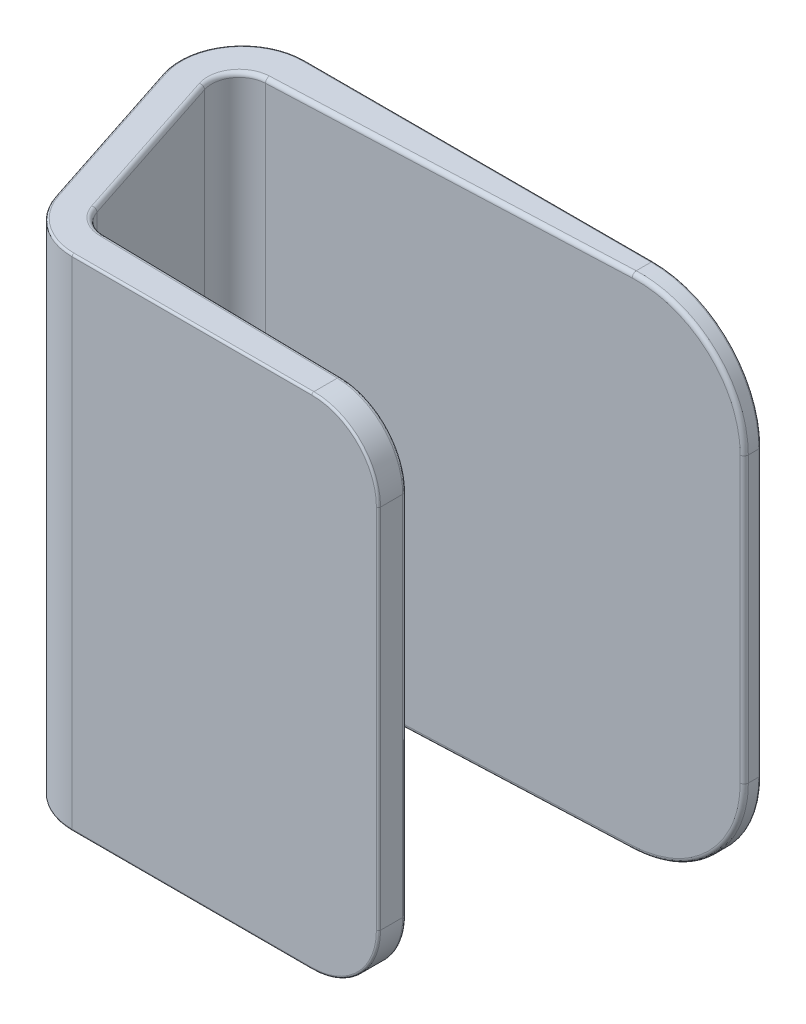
from build123d import *

# Parameters (mm, degrees)
BOSS_EXTRUDE1_DEPTH = 152.4
FILLET1_R           = 19.05
FILLET2_R           = 8.382
FILLET3_R           = 20.32
FILLET4_R           = 32.87776
FILLET5_R           = 0.635
FILLET6_R           = 1.27


with BuildPart() as part:
    # Sketch2 → Boss-Extrude1 (new body)
    with BuildSketch(Plane(origin=(0, 0, 0), x_dir=(1, 0, 0), z_dir=(0, 1, 0))):
        Polygon((165.424623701, 0), (0, 0), (28.419570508, -86.872569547), (135.656203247, -86.872569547), (135.656203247, -78.232006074), (35.451480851, -76.324704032), (14.209785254, -11.393368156), (165.424623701, -5.068012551), align=None)
    extrude(amount=BOSS_EXTRUDE1_DEPTH)

    # Fillet1
    fillet1_edges = [part.edges().sort_by_distance(p)[0] for p in [
        (28.419570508, 76.2, 86.872569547),
        (0, 76.2, 0),
    ]]
    fillet(fillet1_edges, radius=FILLET1_R)

    # Fillet2
    fillet2_edges = [part.edges().sort_by_distance(p)[0] for p in [
        (14.209785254, 76.2, 11.393368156),
        (35.451480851, 76.2, 76.324704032),
    ]]
    fillet(fillet2_edges, radius=FILLET2_R)

    # Fillet3
    fillet3_edges = [part.edges().sort_by_distance(p)[0] for p in [
        (135.656203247, 152.4, 82.552287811),
        (135.656203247, 0, 82.552287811),
    ]]
    fillet(fillet3_edges, radius=FILLET3_R)

    # Fillet4
    fillet4_edges = [part.edges().sort_by_distance(p)[0] for p in [
        (165.424623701, 0, 2.534006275),
        (165.424623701, 152.4, 2.534006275),
    ]]
    fillet(fillet4_edges, radius=FILLET4_R)

    # Fillet5
    fillet5_edges = [part.edges().sort_by_distance(p)[0] for p in [
        (78.783605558, 0, 86.872569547),
        (78.783605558, 152.4, 86.872569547),
        (16.147485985, 0, 49.359422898),
        (10.852498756, 0, 7.868168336),
        (31.049176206, 0, 83.245576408),
        (16.147485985, 152.4, 49.359422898),
        (10.852498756, 152.4, 7.868168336),
        (31.049176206, 152.4, 83.245576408),
        (135.656203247, 76.2, 86.872569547),
        (129.70461304, 146.448409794, 86.872569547),
        (129.70461304, 5.951590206, 86.872569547),
        (165.424623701, 76.2, 0),
        (79.411184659, 0, 0),
        (79.411184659, 152.4, 0),
        (155.794950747, 142.770327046, 0),
        (155.794950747, 9.629672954, 0),
    ]]
    fillet(fillet5_edges, radius=FILLET5_R)

    # Fillet6
    fillet6_edges = [part.edges().sort_by_distance(p)[0] for p in [
        (25.625156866, 0, 46.287726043),
        (25.625156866, 152.4, 46.287726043),
        (78.906924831, 0, 8.687070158),
        (78.906924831, 152.4, 8.687070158),
        (36.581733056, 0, 74.796569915),
        (36.581733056, 152.4, 74.796569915),
        (18.729825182, 0, 14.528427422),
        (18.729825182, 152.4, 14.528427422),
        (135.656203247, 76.2, 78.232006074),
        (78.371389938, 0, 77.141643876),
        (78.371389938, 152.4, 77.141643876),
        (129.703962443, 146.449060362, 78.118710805),
        (129.703962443, 5.950939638, 78.118710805),
        (165.424623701, 76.2, 5.068012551),
        (155.789869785, 142.775406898, 5.471036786),
        (155.789869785, 9.624593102, 5.471036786),
    ]]
    fillet(fillet6_edges, radius=FILLET6_R)


solid = part.part
